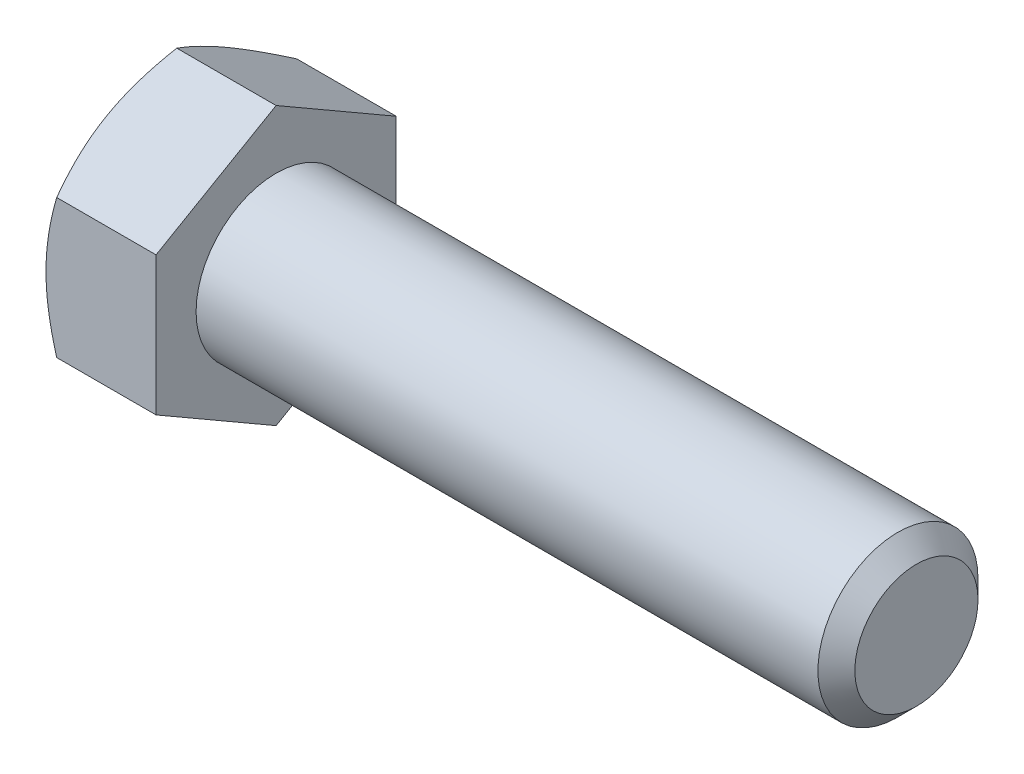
ISO-10303-21;
HEADER;
FILE_DESCRIPTION(('STEP AP214'),'2;1');
FILE_NAME('part.step','',(''),(''),'','','');
FILE_SCHEMA(('AUTOMOTIVE_DESIGN { 1 0 10303 214 1 1 1 1 }'));
ENDSEC;
DATA;
#1=APPLICATION_CONTEXT('core data for automotive mechanical design processes');
#2=APPLICATION_PROTOCOL_DEFINITION('international standard','automotive_design',2000,#1);
#3=PRODUCT_CONTEXT('',#1,'mechanical');
#4=PRODUCT('Part','Part','',(#3));
#5=PRODUCT_RELATED_PRODUCT_CATEGORY('part','',(#4));
#6=PRODUCT_DEFINITION_FORMATION('','',#4);
#7=PRODUCT_DEFINITION_CONTEXT('part definition',#1,'design');
#8=PRODUCT_DEFINITION('design','',#6,#7);
#9=PRODUCT_DEFINITION_SHAPE('','',#8);
#10=(LENGTH_UNIT() NAMED_UNIT(*) SI_UNIT(.MILLI.,.METRE.));
#11=(NAMED_UNIT(*) PLANE_ANGLE_UNIT() SI_UNIT($,.RADIAN.));
#12=(NAMED_UNIT(*) SI_UNIT($,.STERADIAN.) SOLID_ANGLE_UNIT());
#13=UNCERTAINTY_MEASURE_WITH_UNIT(LENGTH_MEASURE(1.E-05),#10,'distance_accuracy_value','');
#14=(GEOMETRIC_REPRESENTATION_CONTEXT(3) GLOBAL_UNCERTAINTY_ASSIGNED_CONTEXT((#13)) GLOBAL_UNIT_ASSIGNED_CONTEXT((#10,
#11,#12)) REPRESENTATION_CONTEXT('',''));
#15=CARTESIAN_POINT('',(0.,0.,0.));
#16=DIRECTION('',(0.,0.,1.));
#17=DIRECTION('',(1.,0.,0.));
#18=AXIS2_PLACEMENT_3D('',#15,#16,#17);
#19=CARTESIAN_POINT('',(-29.765625,-5.49926131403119,9.525));
#20=DIRECTION('',(0.,0.,-1.));
#21=DIRECTION('',(0.,1.,0.));
#22=AXIS2_PLACEMENT_3D('',#19,#20,#21);
#23=PLANE('',#22);
#24=CARTESIAN_POINT('',(-24.9680804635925,-15.0780306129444,9.52500000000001));
#25=CARTESIAN_POINT('',(-25.0702697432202,-14.8686711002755,9.52500000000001));
#26=CARTESIAN_POINT('',(-25.1719720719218,-14.6590740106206,9.52500000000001));
#27=CARTESIAN_POINT('',(-25.3742930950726,-14.2393552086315,9.52500000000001));
#28=CARTESIAN_POINT('',(-25.4749117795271,-14.0292334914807,9.52500000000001));
#29=CARTESIAN_POINT('',(-25.7750023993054,-13.3979552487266,9.52500000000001));
#30=CARTESIAN_POINT('',(-25.9726807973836,-12.9759430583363,9.525));
#31=CARTESIAN_POINT('',(-26.3631154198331,-12.1270415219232,9.525));
#32=CARTESIAN_POINT('',(-26.5558415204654,-11.70013828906,9.525));
#33=CARTESIAN_POINT('',(-26.9338070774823,-10.8430420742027,9.525));
#34=CARTESIAN_POINT('',(-27.1190468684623,-10.4128492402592,9.525));
#35=CARTESIAN_POINT('',(-27.486297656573,-9.533575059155,9.525));
#36=CARTESIAN_POINT('',(-27.6679765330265,-9.08435426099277,9.525));
#37=CARTESIAN_POINT('',(-28.0183114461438,-8.18077271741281,9.525));
#38=CARTESIAN_POINT('',(-28.1869660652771,-7.72641141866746,9.525));
#39=CARTESIAN_POINT('',(-28.5070479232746,-6.81257588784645,9.525));
#40=CARTESIAN_POINT('',(-28.6585075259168,-6.3531131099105,9.525));
#41=CARTESIAN_POINT('',(-28.9395447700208,-5.42761998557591,9.525));
#42=CARTESIAN_POINT('',(-29.069128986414,-4.96159165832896,9.525));
#43=CARTESIAN_POINT('',(-29.299704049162,-4.0252245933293,9.525));
#44=CARTESIAN_POINT('',(-29.4008578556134,-3.55492706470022,9.525));
#45=CARTESIAN_POINT('',(-29.5270390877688,-2.84496405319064,9.525));
#46=CARTESIAN_POINT('',(-29.5648428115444,-2.60754199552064,9.525));
#47=CARTESIAN_POINT('',(-29.6312009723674,-2.1314165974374,9.525));
#48=CARTESIAN_POINT('',(-29.6597563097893,-1.89271338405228,9.525));
#49=CARTESIAN_POINT('',(-29.7066739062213,-1.41759655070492,9.525));
#50=CARTESIAN_POINT('',(-29.7251701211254,-1.18119621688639,9.525));
#51=CARTESIAN_POINT('',(-29.7521382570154,-0.707824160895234,9.525));
#52=CARTESIAN_POINT('',(-29.7606103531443,-0.470852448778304,9.525));
#53=CARTESIAN_POINT('',(-29.7673266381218,0.00323921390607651,9.525));
#54=CARTESIAN_POINT('',(-29.7655707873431,0.240359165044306,9.525));
#55=CARTESIAN_POINT('',(-29.7518771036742,0.714307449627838,9.525));
#56=CARTESIAN_POINT('',(-29.7399388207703,0.951135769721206,9.525));
#57=CARTESIAN_POINT('',(-29.6999255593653,1.51120146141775,9.525));
#58=CARTESIAN_POINT('',(-29.6675266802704,1.83413726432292,9.525));
#59=CARTESIAN_POINT('',(-29.5854961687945,2.47779464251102,9.525));
#60=CARTESIAN_POINT('',(-29.535862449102,2.79851594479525,9.525));
#61=CARTESIAN_POINT('',(-29.3637262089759,3.75687985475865,9.525));
#62=CARTESIAN_POINT('',(-29.218013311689,4.39041902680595,9.525));
#63=CARTESIAN_POINT('',(-28.9629620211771,5.33834577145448,9.525));
#64=CARTESIAN_POINT('',(-28.8705823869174,5.65758071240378,9.525));
#65=CARTESIAN_POINT('',(-28.6756386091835,6.29295646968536,9.525));
#66=CARTESIAN_POINT('',(-28.5730743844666,6.60909726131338,9.525));
#67=CARTESIAN_POINT('',(-28.3594553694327,7.23837692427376,9.525));
#68=CARTESIAN_POINT('',(-28.2484028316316,7.55151656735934,9.525));
#69=CARTESIAN_POINT('',(-28.0191723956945,8.17515899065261,9.525));
#70=CARTESIAN_POINT('',(-27.9009946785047,8.48566183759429,9.525));
#71=CARTESIAN_POINT('',(-27.5662613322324,9.34033618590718,9.525));
#72=CARTESIAN_POINT('',(-27.3434364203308,9.88205031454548,9.525));
#73=CARTESIAN_POINT('',(-26.8841777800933,10.9597012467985,9.525));
#74=CARTESIAN_POINT('',(-26.6477423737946,11.4956373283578,9.525));
#75=CARTESIAN_POINT('',(-26.1645679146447,12.5631015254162,9.525));
#76=CARTESIAN_POINT('',(-25.9178245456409,13.0946276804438,9.525));
#77=CARTESIAN_POINT('',(-25.4165664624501,14.1539599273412,9.525));
#78=CARTESIAN_POINT('',(-25.1620521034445,14.6817661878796,9.525));
#79=CARTESIAN_POINT('',(-24.6465402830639,15.7353249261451,9.525));
#80=CARTESIAN_POINT('',(-24.3855323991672,16.261072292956,9.525));
#81=CARTESIAN_POINT('',(-23.8587383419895,17.3101696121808,9.525));
#82=CARTESIAN_POINT('',(-23.5929521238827,17.8335195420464,9.525));
#83=CARTESIAN_POINT('',(-23.0576253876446,18.8781322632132,9.525));
#84=CARTESIAN_POINT('',(-22.7880858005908,19.3993955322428,9.52499999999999));
#85=CARTESIAN_POINT('',(-22.2459062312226,20.4403080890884,9.52499999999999));
#86=CARTESIAN_POINT('',(-21.9732662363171,20.9599573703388,9.52499999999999));
#87=CARTESIAN_POINT('',(-21.211834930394,22.4026775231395,9.52499999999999));
#88=CARTESIAN_POINT('',(-20.7203004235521,23.3243002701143,9.52499999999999));
#89=CARTESIAN_POINT('',(-19.7314275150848,25.1645006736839,9.52499999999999));
#90=CARTESIAN_POINT('',(-19.2340887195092,26.0830781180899,9.52499999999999));
#91=CARTESIAN_POINT('',(-18.2368754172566,27.9146251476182,9.52499999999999));
#92=CARTESIAN_POINT('',(-17.7370161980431,28.8276030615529,9.52499999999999));
#93=CARTESIAN_POINT('',(-16.9847927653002,30.1956794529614,9.52499999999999));
#94=CARTESIAN_POINT('',(-16.7336564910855,30.6514539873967,9.52499999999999));
#95=CARTESIAN_POINT('',(-16.2306570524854,31.562601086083,9.52499999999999));
#96=CARTESIAN_POINT('',(-15.9787938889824,32.0179736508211,9.52499999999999));
#97=CARTESIAN_POINT('',(-15.7266127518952,32.4731701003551,9.52499999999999));
#98=B_SPLINE_CURVE_WITH_KNOTS('',3,(#24,#25,#26,#27,#28,#29,#30,#31,#32,#33,#34,#35,#36,#37,#38,
#39,#40,#41,#42,#43,#44,#45,#46,#47,#48,#49,#50,#51,#52,#53,#54,#55,#56,#57,#58,#59,#60,#61,#62,
#63,#64,#65,#66,#67,#68,#69,#70,#71,#72,#73,#74,#75,#76,#77,#78,#79,#80,#81,#82,#83,#84,#85,#86,
#87,#88,#89,#90,#91,#92,#93,#94,#95,#96,#97),.UNSPECIFIED.,.F.,.F.,(4,2,2,2,2,2,2,2,2,2,2,2,2,2,
2,2,2,2,2,2,2,2,2,2,2,2,2,2,2,2,2,2,2,2,2,2,4),(0.,0.698902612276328,1.39781166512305,
2.79582156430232,4.20093692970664,5.60598942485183,7.05953778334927,8.51324412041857,
9.96416732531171,11.4146536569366,12.8566480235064,13.5777350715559,14.2987518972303,
15.0099160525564,15.7210677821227,16.4322222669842,17.1434081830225,18.1165357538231,
19.0897812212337,21.0371813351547,22.0340871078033,23.0310008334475,24.0276509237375,
25.0242757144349,26.781248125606,28.5384376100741,30.2963703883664,32.0542229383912,
33.8151066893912,35.5760069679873,37.3364779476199,39.0969560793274,42.230444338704,
45.364146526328,48.4867147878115,50.0478673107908,51.6090179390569),.UNSPECIFIED.);
#99=CARTESIAN_POINT('',(-28.9148863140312,-5.49926131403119,9.525));
#100=VERTEX_POINT('',#99);
#101=CARTESIAN_POINT('',(-29.765625,0.,9.525));
#102=VERTEX_POINT('',#101);
#103=EDGE_CURVE('E282',#100,#102,#98,.T.);
#104=ORIENTED_EDGE('',*,*,#103,.F.);
#105=DIRECTION('',(1.,0.,0.));
#106=VECTOR('',#105,1.);
#107=CARTESIAN_POINT('',(-29.765625,-5.49926131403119,9.525));
#108=LINE('',#107,#106);
#109=CARTESIAN_POINT('',(-21.034375,-5.49926131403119,9.525));
#110=VERTEX_POINT('',#109);
#111=EDGE_CURVE('E290',#100,#110,#108,.T.);
#112=ORIENTED_EDGE('',*,*,#111,.T.);
#113=DIRECTION('',(0.,1.,0.));
#114=VECTOR('',#113,1.);
#115=CARTESIAN_POINT('',(-21.034375,-5.49926131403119,9.525));
#116=LINE('',#115,#114);
#117=CARTESIAN_POINT('',(-21.034375,5.49926131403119,9.525));
#118=VERTEX_POINT('',#117);
#119=EDGE_CURVE('E289',#110,#118,#116,.T.);
#120=ORIENTED_EDGE('',*,*,#119,.T.);
#121=DIRECTION('',(1.,0.,0.));
#122=VECTOR('',#121,1.);
#123=CARTESIAN_POINT('',(-29.765625,5.49926131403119,9.525));
#124=LINE('',#123,#122);
#125=CARTESIAN_POINT('',(-28.9148863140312,5.49926131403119,9.525));
#126=VERTEX_POINT('',#125);
#127=EDGE_CURVE('E246',#126,#118,#124,.T.);
#128=ORIENTED_EDGE('',*,*,#127,.F.);
#129=EDGE_CURVE('E124',#102,#126,#98,.T.);
#130=ORIENTED_EDGE('',*,*,#129,.F.);
#131=EDGE_LOOP('',(#104,#112,#120,#128,#130));
#132=FACE_BOUND('',#131,.T.);
#133=ADVANCED_FACE('F46',(#132),#23,.F.);
#134=CARTESIAN_POINT('',(-29.765625,5.49926131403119,9.525));
#135=DIRECTION('',(0.,-0.866025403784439,-0.5));
#136=DIRECTION('',(0.,0.5,-0.866025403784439));
#137=AXIS2_PLACEMENT_3D('',#134,#135,#136);
#138=PLANE('',#137);
#139=CARTESIAN_POINT('',(-28.9148196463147,5.49914584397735,9.5252));
#140=CARTESIAN_POINT('',(-28.9846017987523,5.6200316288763,9.31581967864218));
#141=CARTESIAN_POINT('',(-29.0512167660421,5.74136813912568,9.10565867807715));
#142=CARTESIAN_POINT('',(-29.17723353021,5.98501418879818,8.68365134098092));
#143=CARTESIAN_POINT('',(-29.2366329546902,6.10732403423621,8.47180447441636));
#144=CARTESIAN_POINT('',(-29.4028583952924,6.47622435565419,7.83285037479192));
#145=CARTESIAN_POINT('',(-29.4974066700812,6.72427111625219,7.40322078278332));
#146=CARTESIAN_POINT('',(-29.6082733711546,7.09546173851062,6.76029976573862));
#147=CARTESIAN_POINT('',(-29.639855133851,7.21749664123,6.54892911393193));
#148=CARTESIAN_POINT('',(-29.6928157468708,7.46213146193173,6.12520917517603));
#149=CARTESIAN_POINT('',(-29.714194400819,7.58473139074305,5.91285986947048));
#150=CARTESIAN_POINT('',(-29.7462010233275,7.83013575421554,5.48780704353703));
#151=CARTESIAN_POINT('',(-29.7568417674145,7.9529397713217,5.27510424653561));
#152=CARTESIAN_POINT('',(-29.7671464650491,8.19866123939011,4.84950217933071));
#153=CARTESIAN_POINT('',(-29.7668107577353,8.32157868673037,4.63660291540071));
#154=CARTESIAN_POINT('',(-29.7559261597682,8.55137586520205,4.23858252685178));
#155=CARTESIAN_POINT('',(-29.7467050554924,8.658271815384,4.0534333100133));
#156=CARTESIAN_POINT('',(-29.7201401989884,8.87181370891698,3.68356790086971));
#157=CARTESIAN_POINT('',(-29.7027958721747,8.97845963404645,3.49885174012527));
#158=CARTESIAN_POINT('',(-29.6389881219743,9.29798418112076,2.94541899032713));
#159=CARTESIAN_POINT('',(-29.5807578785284,9.51029722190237,2.57768201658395));
#160=CARTESIAN_POINT('',(-29.4351817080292,9.93717543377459,1.83830726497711));
#161=CARTESIAN_POINT('',(-29.3472187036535,10.1516861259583,1.46676384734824));
#162=CARTESIAN_POINT('',(-29.147579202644,10.5775086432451,0.729217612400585));
#163=CARTESIAN_POINT('',(-29.0359495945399,10.7888259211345,0.363205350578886));
#164=CARTESIAN_POINT('',(-28.9148196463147,10.9986380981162,-0.00019999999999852));
#165=B_SPLINE_CURVE_WITH_KNOTS('',3,(#139,#140,#141,#142,#143,#144,#145,#146,#147,#148,#149,
#150,#151,#152,#153,#154,#155,#156,#157,#158,#159,#160,#161,#162,#163,#164),.UNSPECIFIED.,.F.,
.F.,(4,2,2,2,2,2,2,2,2,2,2,2,4),(0.,0.754861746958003,1.50997101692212,3.02340406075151,
3.76154608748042,4.49970232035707,5.23697928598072,5.97423347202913,6.61604550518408,
7.25790294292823,8.54252993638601,9.85564695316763,11.1661863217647),.UNSPECIFIED.);
#166=CARTESIAN_POINT('',(-29.765625,8.24889197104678,4.7625));
#167=VERTEX_POINT('',#166);
#168=EDGE_CURVE('E118',#126,#167,#165,.T.);
#169=ORIENTED_EDGE('',*,*,#168,.F.);
#170=ORIENTED_EDGE('',*,*,#127,.T.);
#171=DIRECTION('',(0.,0.5,-0.866025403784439));
#172=VECTOR('',#171,1.);
#173=CARTESIAN_POINT('',(-21.034375,5.49926131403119,9.525));
#174=LINE('',#173,#172);
#175=CARTESIAN_POINT('',(-21.034375,10.9985226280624,0.));
#176=VERTEX_POINT('',#175);
#177=EDGE_CURVE('E313',#118,#176,#174,.T.);
#178=ORIENTED_EDGE('',*,*,#177,.T.);
#179=DIRECTION('',(1.,0.,0.));
#180=VECTOR('',#179,1.);
#181=CARTESIAN_POINT('',(-29.765625,10.9985226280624,0.));
#182=LINE('',#181,#180);
#183=CARTESIAN_POINT('',(-28.9148863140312,10.9985226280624,0.));
#184=VERTEX_POINT('',#183);
#185=EDGE_CURVE('E144',#184,#176,#182,.T.);
#186=ORIENTED_EDGE('',*,*,#185,.F.);
#187=EDGE_CURVE('E127',#167,#184,#165,.T.);
#188=ORIENTED_EDGE('',*,*,#187,.F.);
#189=EDGE_LOOP('',(#169,#170,#178,#186,#188));
#190=FACE_BOUND('',#189,.T.);
#191=ADVANCED_FACE('F145',(#190),#138,.F.);
#192=CARTESIAN_POINT('',(-29.765625,10.9985226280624,0.));
#193=DIRECTION('',(0.,-0.866025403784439,0.5));
#194=DIRECTION('',(0.,-0.5,-0.866025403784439));
#195=AXIS2_PLACEMENT_3D('',#192,#193,#194);
#196=PLANE('',#195);
#197=CARTESIAN_POINT('',(-28.9148196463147,10.9986380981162,0.000200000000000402));
#198=CARTESIAN_POINT('',(-28.9846017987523,10.8777523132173,-0.209180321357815));
#199=CARTESIAN_POINT('',(-29.0512167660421,10.7564158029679,-0.419341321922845));
#200=CARTESIAN_POINT('',(-29.17723353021,10.5127697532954,-0.841348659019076));
#201=CARTESIAN_POINT('',(-29.2366329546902,10.3904599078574,-1.05319552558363));
#202=CARTESIAN_POINT('',(-29.4028583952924,10.0215595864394,-1.69214962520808));
#203=CARTESIAN_POINT('',(-29.4974066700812,9.77351282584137,-2.12177921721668));
#204=CARTESIAN_POINT('',(-29.6082733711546,9.40232220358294,-2.76470023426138));
#205=CARTESIAN_POINT('',(-29.639855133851,9.28028730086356,-2.97607088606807));
#206=CARTESIAN_POINT('',(-29.6928157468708,9.03565248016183,-3.39979082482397));
#207=CARTESIAN_POINT('',(-29.714194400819,8.9130525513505,-3.61214013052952));
#208=CARTESIAN_POINT('',(-29.7462010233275,8.66764818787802,-4.03719295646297));
#209=CARTESIAN_POINT('',(-29.7568417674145,8.54484417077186,-4.24989575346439));
#210=CARTESIAN_POINT('',(-29.7671464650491,8.29912270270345,-4.67549782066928));
#211=CARTESIAN_POINT('',(-29.7668107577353,8.17620525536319,-4.88839708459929));
#212=CARTESIAN_POINT('',(-29.7559261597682,7.9464080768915,-5.28641747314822));
#213=CARTESIAN_POINT('',(-29.7467050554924,7.83951212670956,-5.4715666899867));
#214=CARTESIAN_POINT('',(-29.7201401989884,7.62597023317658,-5.84143209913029));
#215=CARTESIAN_POINT('',(-29.7027958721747,7.5193243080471,-6.02614825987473));
#216=CARTESIAN_POINT('',(-29.6389881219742,7.19979976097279,-6.57958100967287));
#217=CARTESIAN_POINT('',(-29.5807578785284,6.98748672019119,-6.94731798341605));
#218=CARTESIAN_POINT('',(-29.4351817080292,6.56060850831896,-7.68669273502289));
#219=CARTESIAN_POINT('',(-29.3472187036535,6.34609781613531,-8.05823615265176));
#220=CARTESIAN_POINT('',(-29.147579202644,5.92027529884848,-8.79578238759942));
#221=CARTESIAN_POINT('',(-29.0359495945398,5.70895802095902,-9.16179464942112));
#222=CARTESIAN_POINT('',(-28.9148196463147,5.49914584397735,-9.5252));
#223=B_SPLINE_CURVE_WITH_KNOTS('',3,(#197,#198,#199,#200,#201,#202,#203,#204,#205,#206,#207,
#208,#209,#210,#211,#212,#213,#214,#215,#216,#217,#218,#219,#220,#221,#222),.UNSPECIFIED.,.F.,
.F.,(4,2,2,2,2,2,2,2,2,2,2,2,4),(0.,0.754861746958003,1.50997101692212,3.02340406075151,
3.76154608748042,4.49970232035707,5.23697928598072,5.97423347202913,6.61604550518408,
7.25790294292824,8.54252993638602,9.85564695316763,11.1661863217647),.UNSPECIFIED.);
#224=CARTESIAN_POINT('',(-29.765625,8.24889197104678,-4.7625));
#225=VERTEX_POINT('',#224);
#226=EDGE_CURVE('E131',#184,#225,#223,.T.);
#227=ORIENTED_EDGE('',*,*,#226,.F.);
#228=ORIENTED_EDGE('',*,*,#185,.T.);
#229=DIRECTION('',(0.,-0.5,-0.866025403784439));
#230=VECTOR('',#229,1.);
#231=CARTESIAN_POINT('',(-21.034375,10.9985226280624,0.));
#232=LINE('',#231,#230);
#233=CARTESIAN_POINT('',(-21.034375,5.49926131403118,-9.525));
#234=VERTEX_POINT('',#233);
#235=EDGE_CURVE('E311',#176,#234,#232,.T.);
#236=ORIENTED_EDGE('',*,*,#235,.T.);
#237=DIRECTION('',(1.,0.,0.));
#238=VECTOR('',#237,1.);
#239=CARTESIAN_POINT('',(-29.765625,5.49926131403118,-9.525));
#240=LINE('',#239,#238);
#241=CARTESIAN_POINT('',(-28.9148863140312,5.49926131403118,-9.525));
#242=VERTEX_POINT('',#241);
#243=EDGE_CURVE('E306',#242,#234,#240,.T.);
#244=ORIENTED_EDGE('',*,*,#243,.F.);
#245=EDGE_CURVE('E149',#225,#242,#223,.T.);
#246=ORIENTED_EDGE('',*,*,#245,.F.);
#247=EDGE_LOOP('',(#227,#228,#236,#244,#246));
#248=FACE_BOUND('',#247,.T.);
#249=ADVANCED_FACE('F206',(#248),#196,.F.);
#250=CARTESIAN_POINT('',(-29.765625,5.49926131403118,-9.525));
#251=DIRECTION('',(0.,0.,1.));
#252=DIRECTION('',(1.,0.,0.));
#253=AXIS2_PLACEMENT_3D('',#250,#251,#252);
#254=PLANE('',#253);
#255=CARTESIAN_POINT('',(-24.9680804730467,-15.0780305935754,-9.525));
#256=CARTESIAN_POINT('',(-25.0702697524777,-14.8686710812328,-9.525));
#257=CARTESIAN_POINT('',(-25.1719720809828,-14.6590739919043,-9.525));
#258=CARTESIAN_POINT('',(-25.3742931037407,-14.2393551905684,-9.525));
#259=CARTESIAN_POINT('',(-25.474911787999,-14.0292334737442,-9.525));
#260=CARTESIAN_POINT('',(-25.7750024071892,-13.3979552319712,-9.525));
#261=CARTESIAN_POINT('',(-25.9726808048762,-12.9759430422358,-9.525));
#262=CARTESIAN_POINT('',(-26.3631154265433,-12.1270415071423,-9.525));
#263=CARTESIAN_POINT('',(-26.5558415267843,-11.7001382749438,-9.525));
#264=CARTESIAN_POINT('',(-26.9338070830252,-10.8430420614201,-9.525));
#265=CARTESIAN_POINT('',(-27.1190468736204,-10.4128492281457,-9.525));
#266=CARTESIAN_POINT('',(-27.4862976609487,-9.53357504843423,-9.525));
#267=CARTESIAN_POINT('',(-27.6679765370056,-9.08435425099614,-9.525));
#268=CARTESIAN_POINT('',(-28.0183114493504,-8.18077270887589,-9.525));
#269=CARTESIAN_POINT('',(-28.1869660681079,-7.72641141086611,-9.525));
#270=CARTESIAN_POINT('',(-28.507047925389,-6.81257588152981,-9.525));
#271=CARTESIAN_POINT('',(-28.6585075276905,-6.35311310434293,-9.525));
#272=CARTESIAN_POINT('',(-28.9395447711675,-5.42761998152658,-9.525));
#273=CARTESIAN_POINT('',(-29.0691289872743,-4.96159165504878,-9.525));
#274=CARTESIAN_POINT('',(-29.2997040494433,-4.0252245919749,-9.525));
#275=CARTESIAN_POINT('',(-29.4008578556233,-3.55492706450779,-9.525));
#276=CARTESIAN_POINT('',(-29.5270390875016,-2.8449640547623,-9.525));
#277=CARTESIAN_POINT('',(-29.5648428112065,-2.60754199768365,-9.525));
#278=CARTESIAN_POINT('',(-29.6312009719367,-2.13141660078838,-9.525));
#279=CARTESIAN_POINT('',(-29.6597563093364,-1.89271338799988,-9.525));
#280=CARTESIAN_POINT('',(-29.706673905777,-1.41759655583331,-9.525));
#281=CARTESIAN_POINT('',(-29.7251701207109,-1.1811962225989,-9.525));
#282=CARTESIAN_POINT('',(-29.7521382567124,-0.70782416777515,-9.525));
#283=CARTESIAN_POINT('',(-29.7606103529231,-0.470852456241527,-9.525));
#284=CARTESIAN_POINT('',(-29.7673266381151,0.00323920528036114,-9.525));
#285=CARTESIAN_POINT('',(-29.7655707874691,0.240359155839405,-9.525));
#286=CARTESIAN_POINT('',(-29.7518771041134,0.714307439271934,-9.525));
#287=CARTESIAN_POINT('',(-29.7399388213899,0.951135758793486,-9.525));
#288=CARTESIAN_POINT('',(-29.6999255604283,1.51120144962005,-9.525));
#289=CARTESIAN_POINT('',(-29.6675266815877,1.83413725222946,-9.525));
#290=CARTESIAN_POINT('',(-29.5854961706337,2.47779462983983,-9.525));
#291=CARTESIAN_POINT('',(-29.5358624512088,2.79851593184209,-9.525));
#292=CARTESIAN_POINT('',(-29.363726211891,3.75687984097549,-9.525));
#293=CARTESIAN_POINT('',(-29.2180133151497,4.39041901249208,-9.525));
#294=CARTESIAN_POINT('',(-28.9629620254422,5.338345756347,-9.525));
#295=CARTESIAN_POINT('',(-28.8705823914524,5.65758069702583,-9.525));
#296=CARTESIAN_POINT('',(-28.6756386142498,6.2929564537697,-9.525));
#297=CARTESIAN_POINT('',(-28.5730743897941,6.60909724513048,-9.525));
#298=CARTESIAN_POINT('',(-28.359455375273,7.23837690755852,-9.525));
#299=CARTESIAN_POINT('',(-28.2484028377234,7.55151655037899,-9.525));
#300=CARTESIAN_POINT('',(-28.0191724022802,8.175158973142,-9.525));
#301=CARTESIAN_POINT('',(-27.9009946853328,8.48566181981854,-9.525));
#302=CARTESIAN_POINT('',(-27.5662613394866,9.34033616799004,-9.525));
#303=CARTESIAN_POINT('',(-27.3434364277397,9.88205029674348,-9.525));
#304=CARTESIAN_POINT('',(-26.8841777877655,10.9597012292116,-9.525));
#305=CARTESIAN_POINT('',(-26.6477423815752,11.4956373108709,-9.525));
#306=CARTESIAN_POINT('',(-26.1645679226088,12.5631015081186,-9.525));
#307=CARTESIAN_POINT('',(-25.9178245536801,13.0946276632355,-9.525));
#308=CARTESIAN_POINT('',(-25.4165664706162,14.1539599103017,-9.525));
#309=CARTESIAN_POINT('',(-25.1620521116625,14.6817661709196,-9.525));
#310=CARTESIAN_POINT('',(-24.6465402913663,15.7353249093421,-9.525));
#311=CARTESIAN_POINT('',(-24.385532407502,16.2610722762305,-9.525));
#312=CARTESIAN_POINT('',(-23.8587383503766,17.3101695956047,-9.525));
#313=CARTESIAN_POINT('',(-23.5929521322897,17.833519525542,-9.525));
#314=CARTESIAN_POINT('',(-23.0576253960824,18.8781322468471,-9.525));
#315=CARTESIAN_POINT('',(-22.7880858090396,19.3993955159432,-9.525));
#316=CARTESIAN_POINT('',(-22.2459062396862,20.4403080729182,-9.525));
#317=CARTESIAN_POINT('',(-21.9732662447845,20.9599573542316,-9.525));
#318=CARTESIAN_POINT('',(-21.211834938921,22.4026775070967,-9.525));
#319=CARTESIAN_POINT('',(-20.7203004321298,23.3243002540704,-9.525));
#320=CARTESIAN_POINT('',(-19.7314275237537,25.1645006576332,-9.525));
#321=CARTESIAN_POINT('',(-19.2340887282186,26.0830781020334,-9.525));
#322=CARTESIAN_POINT('',(-18.2368754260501,27.9146251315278,-9.525));
#323=CARTESIAN_POINT('',(-17.7370162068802,28.8276030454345,-9.525));
#324=CARTESIAN_POINT('',(-16.9847927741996,30.195679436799,-9.525));
#325=CARTESIAN_POINT('',(-16.7336565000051,30.6514539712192,-9.525));
#326=CARTESIAN_POINT('',(-16.2306570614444,31.5626010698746,-9.525));
#327=CARTESIAN_POINT('',(-15.9787938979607,32.017973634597,-9.525));
#328=CARTESIAN_POINT('',(-15.7266127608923,32.4731700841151,-9.525));
#329=B_SPLINE_CURVE_WITH_KNOTS('',3,(#255,#256,#257,#258,#259,#260,#261,#262,#263,#264,#265,
#266,#267,#268,#269,#270,#271,#272,#273,#274,#275,#276,#277,#278,#279,#280,#281,#282,#283,#284,
#285,#286,#287,#288,#289,#290,#291,#292,#293,#294,#295,#296,#297,#298,#299,#300,#301,#302,#303,
#304,#305,#306,#307,#308,#309,#310,#311,#312,#313,#314,#315,#316,#317,#318,#319,#320,#321,#322,
#323,#324,#325,#326,#327,#328),.UNSPECIFIED.,.F.,.F.,(4,2,2,2,2,2,2,2,2,2,2,2,2,2,2,2,2,2,2,2,2,
2,2,2,2,2,2,2,2,2,2,2,2,2,2,2,4),(0.,0.698902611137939,1.39781166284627,2.79582155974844,
4.2009369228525,5.60598941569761,7.05953777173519,8.51324410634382,9.96416730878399,
11.4146536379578,12.856648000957,13.5777350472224,14.2987518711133,15.0099160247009,
15.7210677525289,16.4322222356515,17.1434081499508,18.1165357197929,19.089781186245,
21.0371812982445,22.0340870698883,23.0310007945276,24.0276508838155,25.0242756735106,
26.7812480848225,28.538437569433,30.2963703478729,32.0542228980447,33.8151066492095,
35.5760069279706,37.3364779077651,39.0969560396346,42.2304442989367,45.3641464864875,
48.4867147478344,50.0478672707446,51.6090178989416),.UNSPECIFIED.);
#330=CARTESIAN_POINT('',(-29.765625,0.,-9.525));
#331=VERTEX_POINT('',#330);
#332=EDGE_CURVE('E205',#242,#331,#329,.F.);
#333=ORIENTED_EDGE('',*,*,#332,.F.);
#334=ORIENTED_EDGE('',*,*,#243,.T.);
#335=DIRECTION('',(0.,-1.,0.));
#336=VECTOR('',#335,1.);
#337=CARTESIAN_POINT('',(-21.034375,5.49926131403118,-9.525));
#338=LINE('',#337,#336);
#339=CARTESIAN_POINT('',(-21.034375,-5.49926131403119,-9.525));
#340=VERTEX_POINT('',#339);
#341=EDGE_CURVE('E316',#234,#340,#338,.T.);
#342=ORIENTED_EDGE('',*,*,#341,.T.);
#343=DIRECTION('',(1.,0.,0.));
#344=VECTOR('',#343,1.);
#345=CARTESIAN_POINT('',(-29.765625,-5.49926131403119,-9.525));
#346=LINE('',#345,#344);
#347=CARTESIAN_POINT('',(-28.9148863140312,-5.49926131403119,-9.525));
#348=VERTEX_POINT('',#347);
#349=EDGE_CURVE('E266',#348,#340,#346,.T.);
#350=ORIENTED_EDGE('',*,*,#349,.F.);
#351=EDGE_CURVE('E191',#331,#348,#329,.F.);
#352=ORIENTED_EDGE('',*,*,#351,.F.);
#353=EDGE_LOOP('',(#333,#334,#342,#350,#352));
#354=FACE_BOUND('',#353,.T.);
#355=ADVANCED_FACE('F202',(#354),#254,.F.);
#356=CARTESIAN_POINT('',(-29.765625,-5.49926131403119,-9.525));
#357=DIRECTION('',(0.,0.866025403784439,0.5));
#358=DIRECTION('',(0.,-0.5,0.866025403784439));
#359=AXIS2_PLACEMENT_3D('',#356,#357,#358);
#360=PLANE('',#359);
#361=CARTESIAN_POINT('',(-28.9148196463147,-5.49914584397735,-9.5252));
#362=CARTESIAN_POINT('',(-28.9846017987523,-5.6200316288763,-9.31581967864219));
#363=CARTESIAN_POINT('',(-29.0512167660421,-5.74136813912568,-9.10565867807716));
#364=CARTESIAN_POINT('',(-29.17723353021,-5.98501418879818,-8.68365134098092));
#365=CARTESIAN_POINT('',(-29.2366329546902,-6.10732403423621,-8.47180447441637));
#366=CARTESIAN_POINT('',(-29.4028583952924,-6.4762243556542,-7.83285037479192));
#367=CARTESIAN_POINT('',(-29.4974066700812,-6.7242711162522,-7.40322078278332));
#368=CARTESIAN_POINT('',(-29.6082733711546,-7.09546173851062,-6.76029976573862));
#369=CARTESIAN_POINT('',(-29.639855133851,-7.21749664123,-6.54892911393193));
#370=CARTESIAN_POINT('',(-29.6928157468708,-7.46213146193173,-6.12520917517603));
#371=CARTESIAN_POINT('',(-29.714194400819,-7.58473139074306,-5.91285986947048));
#372=CARTESIAN_POINT('',(-29.7462010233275,-7.83013575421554,-5.48780704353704));
#373=CARTESIAN_POINT('',(-29.7568417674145,-7.9529397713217,-5.27510424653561));
#374=CARTESIAN_POINT('',(-29.7671464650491,-8.19866123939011,-4.84950217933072));
#375=CARTESIAN_POINT('',(-29.7668107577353,-8.32157868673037,-4.63660291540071));
#376=CARTESIAN_POINT('',(-29.7559261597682,-8.55137586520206,-4.23858252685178));
#377=CARTESIAN_POINT('',(-29.7467050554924,-8.658271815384,-4.0534333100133));
#378=CARTESIAN_POINT('',(-29.7201401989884,-8.87181370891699,-3.68356790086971));
#379=CARTESIAN_POINT('',(-29.7027958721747,-8.97845963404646,-3.49885174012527));
#380=CARTESIAN_POINT('',(-29.6389881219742,-9.29798418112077,-2.94541899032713));
#381=CARTESIAN_POINT('',(-29.5807578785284,-9.51029722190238,-2.57768201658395));
#382=CARTESIAN_POINT('',(-29.4351817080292,-9.9371754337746,-1.83830726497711));
#383=CARTESIAN_POINT('',(-29.3472187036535,-10.1516861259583,-1.46676384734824));
#384=CARTESIAN_POINT('',(-29.147579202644,-10.5775086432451,-0.729217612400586));
#385=CARTESIAN_POINT('',(-29.0359495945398,-10.7888259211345,-0.363205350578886));
#386=CARTESIAN_POINT('',(-28.9148196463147,-10.9986380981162,0.0001999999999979));
#387=B_SPLINE_CURVE_WITH_KNOTS('',3,(#361,#362,#363,#364,#365,#366,#367,#368,#369,#370,#371,
#372,#373,#374,#375,#376,#377,#378,#379,#380,#381,#382,#383,#384,#385,#386),.UNSPECIFIED.,.F.,
.F.,(4,2,2,2,2,2,2,2,2,2,2,2,4),(0.,0.754861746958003,1.50997101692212,3.02340406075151,
3.76154608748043,4.49970232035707,5.23697928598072,5.97423347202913,6.61604550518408,
7.25790294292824,8.54252993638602,9.85564695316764,11.1661863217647),.UNSPECIFIED.);
#388=CARTESIAN_POINT('',(-29.765625,-8.24889197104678,-4.7625));
#389=VERTEX_POINT('',#388);
#390=EDGE_CURVE('E201',#348,#389,#387,.T.);
#391=ORIENTED_EDGE('',*,*,#390,.F.);
#392=ORIENTED_EDGE('',*,*,#349,.T.);
#393=DIRECTION('',(0.,-0.5,0.866025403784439));
#394=VECTOR('',#393,1.);
#395=CARTESIAN_POINT('',(-21.034375,-5.49926131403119,-9.525));
#396=LINE('',#395,#394);
#397=CARTESIAN_POINT('',(-21.034375,-10.9985226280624,0.));
#398=VERTEX_POINT('',#397);
#399=EDGE_CURVE('E297',#340,#398,#396,.T.);
#400=ORIENTED_EDGE('',*,*,#399,.T.);
#401=DIRECTION('',(1.,0.,0.));
#402=VECTOR('',#401,1.);
#403=CARTESIAN_POINT('',(-29.765625,-10.9985226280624,0.));
#404=LINE('',#403,#402);
#405=CARTESIAN_POINT('',(-28.9148863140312,-10.9985226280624,0.));
#406=VERTEX_POINT('',#405);
#407=EDGE_CURVE('E294',#406,#398,#404,.T.);
#408=ORIENTED_EDGE('',*,*,#407,.F.);
#409=EDGE_CURVE('E186',#389,#406,#387,.T.);
#410=ORIENTED_EDGE('',*,*,#409,.F.);
#411=EDGE_LOOP('',(#391,#392,#400,#408,#410));
#412=FACE_BOUND('',#411,.T.);
#413=ADVANCED_FACE('F210',(#412),#360,.F.);
#414=CARTESIAN_POINT('',(-29.765625,-10.9985226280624,0.));
#415=DIRECTION('',(0.,0.866025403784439,-0.5));
#416=DIRECTION('',(0.,0.5,0.866025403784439));
#417=AXIS2_PLACEMENT_3D('',#414,#415,#416);
#418=PLANE('',#417);
#419=CARTESIAN_POINT('',(-28.9148196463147,-10.9986380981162,-0.00020000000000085));
#420=CARTESIAN_POINT('',(-28.9846017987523,-10.8777523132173,0.209180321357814));
#421=CARTESIAN_POINT('',(-29.0512167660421,-10.7564158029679,0.419341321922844));
#422=CARTESIAN_POINT('',(-29.17723353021,-10.5127697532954,0.841348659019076));
#423=CARTESIAN_POINT('',(-29.2366329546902,-10.3904599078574,1.05319552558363));
#424=CARTESIAN_POINT('',(-29.4028583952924,-10.0215595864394,1.69214962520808));
#425=CARTESIAN_POINT('',(-29.4974066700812,-9.77351282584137,2.12177921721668));
#426=CARTESIAN_POINT('',(-29.6082733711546,-9.40232220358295,2.76470023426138));
#427=CARTESIAN_POINT('',(-29.639855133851,-9.28028730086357,2.97607088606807));
#428=CARTESIAN_POINT('',(-29.6928157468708,-9.03565248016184,3.39979082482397));
#429=CARTESIAN_POINT('',(-29.714194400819,-8.91305255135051,3.61214013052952));
#430=CARTESIAN_POINT('',(-29.7462010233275,-8.66764818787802,4.03719295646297));
#431=CARTESIAN_POINT('',(-29.7568417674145,-8.54484417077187,4.24989575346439));
#432=CARTESIAN_POINT('',(-29.7671464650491,-8.29912270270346,4.67549782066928));
#433=CARTESIAN_POINT('',(-29.7668107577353,-8.17620525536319,4.88839708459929));
#434=CARTESIAN_POINT('',(-29.7559261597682,-7.94640807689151,5.28641747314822));
#435=CARTESIAN_POINT('',(-29.7467050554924,-7.83951212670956,5.4715666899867));
#436=CARTESIAN_POINT('',(-29.7201401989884,-7.62597023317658,5.84143209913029));
#437=CARTESIAN_POINT('',(-29.7027958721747,-7.51932430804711,6.02614825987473));
#438=CARTESIAN_POINT('',(-29.6389881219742,-7.1997997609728,6.57958100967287));
#439=CARTESIAN_POINT('',(-29.5807578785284,-6.98748672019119,6.94731798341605));
#440=CARTESIAN_POINT('',(-29.4351817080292,-6.56060850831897,7.68669273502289));
#441=CARTESIAN_POINT('',(-29.3472187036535,-6.34609781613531,8.05823615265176));
#442=CARTESIAN_POINT('',(-29.147579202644,-5.92027529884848,8.79578238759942));
#443=CARTESIAN_POINT('',(-29.0359495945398,-5.70895802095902,9.16179464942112));
#444=CARTESIAN_POINT('',(-28.9148196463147,-5.49914584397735,9.5252));
#445=B_SPLINE_CURVE_WITH_KNOTS('',3,(#419,#420,#421,#422,#423,#424,#425,#426,#427,#428,#429,
#430,#431,#432,#433,#434,#435,#436,#437,#438,#439,#440,#441,#442,#443,#444),.UNSPECIFIED.,.F.,
.F.,(4,2,2,2,2,2,2,2,2,2,2,2,4),(0.,0.754861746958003,1.50997101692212,3.02340406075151,
3.76154608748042,4.49970232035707,5.23697928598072,5.97423347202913,6.61604550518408,
7.25790294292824,8.54252993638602,9.85564695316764,11.1661863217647),.UNSPECIFIED.);
#446=CARTESIAN_POINT('',(-29.765625,-8.24889197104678,4.7625));
#447=VERTEX_POINT('',#446);
#448=EDGE_CURVE('E279',#406,#447,#445,.T.);
#449=ORIENTED_EDGE('',*,*,#448,.F.);
#450=ORIENTED_EDGE('',*,*,#407,.T.);
#451=DIRECTION('',(0.,0.5,0.866025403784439));
#452=VECTOR('',#451,1.);
#453=CARTESIAN_POINT('',(-21.034375,-10.9985226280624,0.));
#454=LINE('',#453,#452);
#455=EDGE_CURVE('E292',#398,#110,#454,.T.);
#456=ORIENTED_EDGE('',*,*,#455,.T.);
#457=ORIENTED_EDGE('',*,*,#111,.F.);
#458=EDGE_CURVE('E137',#447,#100,#445,.T.);
#459=ORIENTED_EDGE('',*,*,#458,.F.);
#460=EDGE_LOOP('',(#449,#450,#456,#457,#459));
#461=FACE_BOUND('',#460,.T.);
#462=ADVANCED_FACE('F229',(#461),#418,.F.);
#463=CARTESIAN_POINT('',(-21.034375,0.,0.));
#464=DIRECTION('',(1.,0.,0.));
#465=DIRECTION('',(0.,0.,-1.));
#466=AXIS2_PLACEMENT_3D('',#463,#464,#465);
#467=CYLINDRICAL_SURFACE('',#466,6.35);
#468=CARTESIAN_POINT('',(28.3002403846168,0.,0.));
#469=DIRECTION('',(1.,0.,0.));
#470=DIRECTION('',(0.,0.,-1.));
#471=AXIS2_PLACEMENT_3D('',#468,#469,#470);
#472=CIRCLE('',#471,6.35);
#473=CARTESIAN_POINT('',(28.3002403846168,0.,-6.35));
#474=VERTEX_POINT('',#473);
#475=EDGE_CURVE('E237',#474,#474,#472,.F.);
#476=ORIENTED_EDGE('',*,*,#475,.T.);
#477=EDGE_LOOP('',(#476));
#478=FACE_BOUND('',#477,.T.);
#479=CARTESIAN_POINT('',(-21.034375,0.,0.));
#480=DIRECTION('',(-1.,0.,0.));
#481=DIRECTION('',(0.,0.,1.));
#482=AXIS2_PLACEMENT_3D('',#479,#480,#481);
#483=CIRCLE('',#482,6.35);
#484=CARTESIAN_POINT('',(-21.034375,0.,6.35));
#485=VERTEX_POINT('',#484);
#486=EDGE_CURVE('E245',#485,#485,#483,.F.);
#487=ORIENTED_EDGE('',*,*,#486,.T.);
#488=EDGE_LOOP('',(#487));
#489=FACE_BOUND('',#488,.T.);
#490=ADVANCED_FACE('F227',(#478,#489),#467,.T.);
#491=CARTESIAN_POINT('',(29.765625,0.,0.));
#492=DIRECTION('',(1.,0.,0.));
#493=DIRECTION('',(0.,0.,-1.));
#494=AXIS2_PLACEMENT_3D('',#491,#492,#493);
#495=PLANE('',#494);
#496=CARTESIAN_POINT('',(29.765625,0.,0.));
#497=DIRECTION('',(1.,0.,0.));
#498=DIRECTION('',(0.,0.,-1.));
#499=AXIS2_PLACEMENT_3D('',#496,#497,#498);
#500=CIRCLE('',#499,4.88461538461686);
#501=CARTESIAN_POINT('',(29.765625,0.,-4.88461538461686));
#502=VERTEX_POINT('',#501);
#503=EDGE_CURVE('E244',#502,#502,#500,.T.);
#504=ORIENTED_EDGE('',*,*,#503,.T.);
#505=EDGE_LOOP('',(#504));
#506=FACE_BOUND('',#505,.T.);
#507=ADVANCED_FACE('F224',(#506),#495,.T.);
#508=CARTESIAN_POINT('',(29.765625,0.,0.));
#509=DIRECTION('',(-1.,0.,0.));
#510=DIRECTION('',(0.,0.,1.));
#511=AXIS2_PLACEMENT_3D('',#508,#509,#510);
#512=CONICAL_SURFACE('',#511,4.88461538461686,0.785398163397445);
#513=ORIENTED_EDGE('',*,*,#475,.F.);
#514=EDGE_LOOP('',(#513));
#515=FACE_BOUND('',#514,.T.);
#516=ORIENTED_EDGE('',*,*,#503,.F.);
#517=EDGE_LOOP('',(#516));
#518=FACE_BOUND('',#517,.T.);
#519=ADVANCED_FACE('F48',(#515,#518),#512,.T.);
#520=CARTESIAN_POINT('',(-21.034375,5.49926131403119,9.525));
#521=DIRECTION('',(-1.,0.,0.));
#522=DIRECTION('',(0.,0.,1.));
#523=AXIS2_PLACEMENT_3D('',#520,#521,#522);
#524=PLANE('',#523);
#525=ORIENTED_EDGE('',*,*,#486,.F.);
#526=EDGE_LOOP('',(#525));
#527=FACE_BOUND('',#526,.T.);
#528=ORIENTED_EDGE('',*,*,#119,.F.);
#529=ORIENTED_EDGE('',*,*,#455,.F.);
#530=ORIENTED_EDGE('',*,*,#399,.F.);
#531=ORIENTED_EDGE('',*,*,#341,.F.);
#532=ORIENTED_EDGE('',*,*,#235,.F.);
#533=ORIENTED_EDGE('',*,*,#177,.F.);
#534=EDGE_LOOP('',(#528,#529,#530,#531,#532,#533));
#535=FACE_BOUND('',#534,.T.);
#536=ADVANCED_FACE('F172',(#527,#535),#524,.F.);
#537=CARTESIAN_POINT('',(-29.765625,0.,0.));
#538=DIRECTION('',(1.,0.,0.));
#539=DIRECTION('',(0.,0.,1.));
#540=AXIS2_PLACEMENT_3D('',#537,#538,#539);
#541=CONICAL_SURFACE('',#540,9.525,1.0471975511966);
#542=ORIENTED_EDGE('',*,*,#103,.T.);
#543=CARTESIAN_POINT('',(-29.765625,0.,0.));
#544=DIRECTION('',(-1.,0.,0.));
#545=DIRECTION('',(0.,0.,1.));
#546=AXIS2_PLACEMENT_3D('',#543,#544,#545);
#547=CIRCLE('',#546,9.525);
#548=EDGE_CURVE('E49',#447,#102,#547,.T.);
#549=ORIENTED_EDGE('',*,*,#548,.F.);
#550=ORIENTED_EDGE('',*,*,#458,.T.);
#551=EDGE_LOOP('',(#542,#549,#550));
#552=FACE_BOUND('',#551,.T.);
#553=ADVANCED_FACE('F169',(#552),#541,.T.);
#554=ORIENTED_EDGE('',*,*,#409,.T.);
#555=ORIENTED_EDGE('',*,*,#448,.T.);
#556=EDGE_CURVE('E73',#389,#447,#547,.T.);
#557=ORIENTED_EDGE('',*,*,#556,.F.);
#558=EDGE_LOOP('',(#554,#555,#557));
#559=FACE_BOUND('',#558,.T.);
#560=ADVANCED_FACE('F173',(#559),#541,.T.);
#561=ORIENTED_EDGE('',*,*,#351,.T.);
#562=ORIENTED_EDGE('',*,*,#390,.T.);
#563=EDGE_CURVE('E259',#331,#389,#547,.T.);
#564=ORIENTED_EDGE('',*,*,#563,.F.);
#565=EDGE_LOOP('',(#561,#562,#564));
#566=FACE_BOUND('',#565,.T.);
#567=ADVANCED_FACE('F272',(#566),#541,.T.);
#568=ORIENTED_EDGE('',*,*,#245,.T.);
#569=ORIENTED_EDGE('',*,*,#332,.T.);
#570=EDGE_CURVE('E57',#225,#331,#547,.T.);
#571=ORIENTED_EDGE('',*,*,#570,.F.);
#572=EDGE_LOOP('',(#568,#569,#571));
#573=FACE_BOUND('',#572,.T.);
#574=ADVANCED_FACE('F327',(#573),#541,.T.);
#575=ORIENTED_EDGE('',*,*,#187,.T.);
#576=ORIENTED_EDGE('',*,*,#226,.T.);
#577=EDGE_CURVE('E12',#167,#225,#547,.T.);
#578=ORIENTED_EDGE('',*,*,#577,.F.);
#579=EDGE_LOOP('',(#575,#576,#578));
#580=FACE_BOUND('',#579,.T.);
#581=ADVANCED_FACE('F133',(#580),#541,.T.);
#582=ORIENTED_EDGE('',*,*,#129,.T.);
#583=ORIENTED_EDGE('',*,*,#168,.T.);
#584=CARTESIAN_POINT('',(-29.765625,0.,0.));
#585=DIRECTION('',(-1.,0.,0.));
#586=DIRECTION('',(0.,0.,1.));
#587=AXIS2_PLACEMENT_3D('',#584,#585,#586);
#588=CIRCLE('',#587,9.525);
#589=EDGE_CURVE('E62',#102,#167,#588,.T.);
#590=ORIENTED_EDGE('',*,*,#589,.F.);
#591=EDGE_LOOP('',(#582,#583,#590));
#592=FACE_BOUND('',#591,.T.);
#593=ADVANCED_FACE('F122',(#592),#541,.T.);
#594=CARTESIAN_POINT('',(-29.765625,5.49926131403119,9.525));
#595=DIRECTION('',(-1.,0.,0.));
#596=DIRECTION('',(0.,0.,1.));
#597=AXIS2_PLACEMENT_3D('',#594,#595,#596);
#598=PLANE('',#597);
#599=ORIENTED_EDGE('',*,*,#548,.T.);
#600=ORIENTED_EDGE('',*,*,#589,.T.);
#601=ORIENTED_EDGE('',*,*,#577,.T.);
#602=ORIENTED_EDGE('',*,*,#570,.T.);
#603=ORIENTED_EDGE('',*,*,#563,.T.);
#604=ORIENTED_EDGE('',*,*,#556,.T.);
#605=EDGE_LOOP('',(#599,#600,#601,#602,#603,#604));
#606=FACE_BOUND('',#605,.T.);
#607=ADVANCED_FACE('F140',(#606),#598,.T.);
#608=CLOSED_SHELL('',(#133,#191,#249,#355,#413,#462,#490,#507,#519,#536,#553,#560,#567,#574,
#581,#593,#607));
#609=MANIFOLD_SOLID_BREP('B2',#608);
#610=ADVANCED_BREP_SHAPE_REPRESENTATION('',(#18,#609),#14);
#611=SHAPE_DEFINITION_REPRESENTATION(#9,#610);
ENDSEC;
END-ISO-10303-21;
